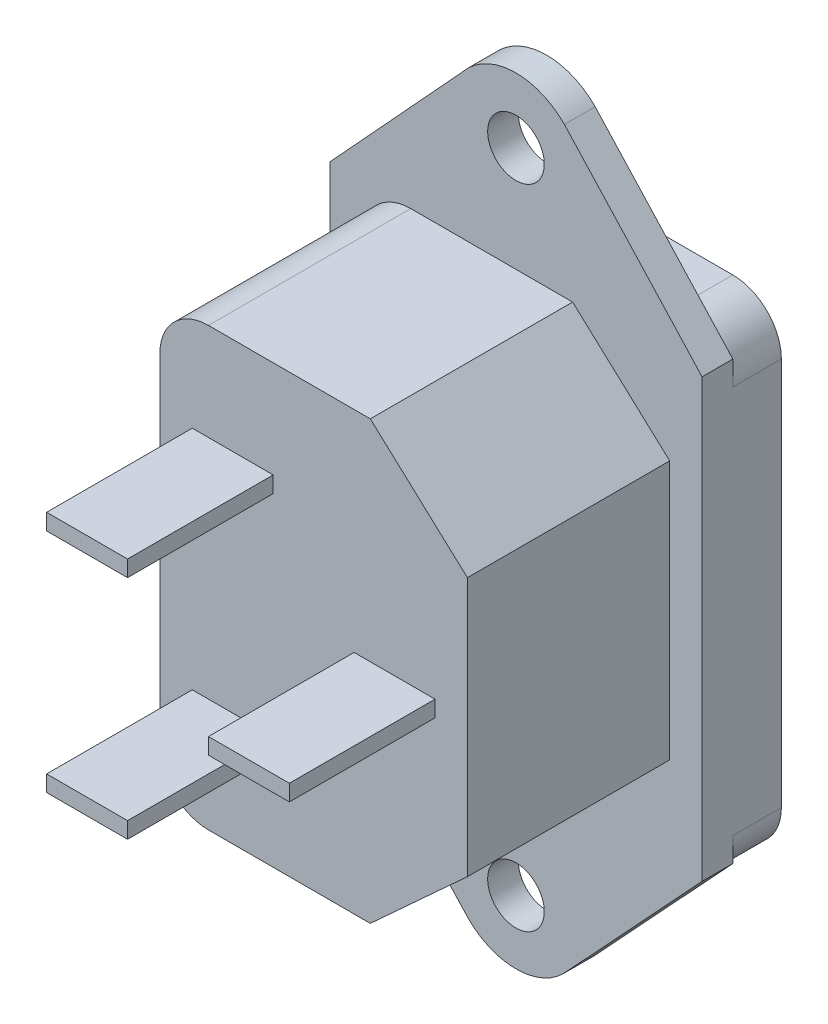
from build123d import *

# Parameters (mm, degrees)
EXTRUDE_1_DEPTH     = 1.9
SKETCH_2_R          = 1.75
CUT_EXTRUDE_1_DEPTH = 1.9
EXTRUDE_2_DEPTH     = 12.5
SKETCH_9_W          = 5
SKETCH_9_H          = 1
EXTRUDE_6_DEPTH     = 9
EXTRUDE_7_DEPTH     = 3
CUT_EXTRUDE_2_DEPTH = 17


with BuildPart() as part:
    # Sketch 1 → Extrude 1 (new body)
    with BuildSketch(Plane.XY):
        with BuildLine():
            Line((11.5, 13.5), (11.5, -13.5))
            Line((11.5, -13.5), (2.930675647, -22.722399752))
            ThreePointArc((2.930675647, -22.722399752), (0.00049131, -23.936201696), (-2.929749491, -22.722536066))
            Line((-2.929749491, -22.722536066), (-11.5, -13.5))
            Line((-11.5, -13.5), (-11.5, 13.5))
            Line((-11.5, 13.5), (-2.929749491, 22.818692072))
            ThreePointArc((-2.929749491, 22.818692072), (0.045048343, 24.011564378), (2.99203616, 22.751552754))
            Line((2.99203616, 22.751552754), (11.5, 13.5))
        make_face()
    extrude(amount=EXTRUDE_1_DEPTH)

    # Sketch 2 → Cut-Extrude 1 (cut)
    with BuildSketch(Plane(origin=(0, 0, 0), x_dir=(-1, 0, 0), z_dir=(0, 0, -1))):
        with Locations((0, 20)):
            Circle(SKETCH_2_R)
        with Locations((0, -20)):
            Circle(SKETCH_2_R)
    extrude(amount=-CUT_EXTRUDE_1_DEPTH, mode=Mode.SUBTRACT)

    # Sketch 3 → Extrude 2 (add)
    with BuildSketch(Plane.XY.offset(1.9)):
        with BuildLine():
            Line((-9.5, -10.5), (-9.5, 10.5))
            ThreePointArc((-9.5, 10.5), (-8.621320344, 12.621320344), (-6.5, 13.5))
            Line((-6.5, 13.5), (3.5, 13.5))
            Line((3.5, 13.5), (9.5, 8))
            Line((9.5, 8), (9.5, -8))
            Line((9.5, -8), (3.5, -13.5))
            Line((3.5, -13.5), (-6.5, -13.5))
            ThreePointArc((-6.5, -13.5), (-8.621320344, -12.621320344), (-9.5, -10.5))
        make_face()
    extrude(amount=EXTRUDE_2_DEPTH)

    # Sketch 9 → Extrude 6 (add)
    with BuildSketch(Plane.XY.offset(14.4)):
        with Locations((-5, -7)):
            Rectangle(SKETCH_9_W, SKETCH_9_H)
        with Locations((-5, 7)):
            Rectangle(SKETCH_9_W, SKETCH_9_H)
        with Locations((5, 0)):
            Rectangle(SKETCH_9_W, SKETCH_9_H)
    extrude(amount=EXTRUDE_6_DEPTH)

    # Sketch 13 → Extrude 7 (add)
    with BuildSketch(Plane(origin=(0, 0, 0), x_dir=(-1, 0, 0), z_dir=(0, 0, -1))):
        with BuildLine():
            Line((-8.5, 15), (8.5, 15))
            ThreePointArc((8.5, 15), (10.621320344, 14.121320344), (11.5, 12))
            Line((11.5, 12), (11.5, -12))
            ThreePointArc((11.5, -12), (10.621320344, -14.121320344), (8.5, -15))
            Line((8.5, -15), (-8.5, -15))
            ThreePointArc((-8.5, -15), (-10.621320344, -14.121320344), (-11.5, -12))
            Line((-11.5, -12), (-11.5, 12))
            ThreePointArc((-11.5, 12), (-10.621320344, 14.121320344), (-8.5, 15))
        make_face()
    extrude(amount=EXTRUDE_7_DEPTH)

    # Sketch 15 → Cut-Extrude 2 (cut)
    with BuildSketch(Plane(origin=(0, 0, -3), x_dir=(-1, 0, 0), z_dir=(0, 0, -1))):
        with BuildLine():
            Line((8, 10), (8, -10))
            ThreePointArc((8, -10), (7.414213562, -11.414213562), (6, -12))
            Line((6, -12), (-3, -12))
            Line((-3, -12), (-8, -7))
            Line((-8, -7), (-8, 7))
            Line((-8, 7), (-3, 12))
            Line((-3, 12), (6, 12))
            ThreePointArc((6, 12), (7.414213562, 11.414213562), (8, 10))
        make_face()
    extrude(amount=-CUT_EXTRUDE_2_DEPTH, mode=Mode.SUBTRACT)


solid = part.part
